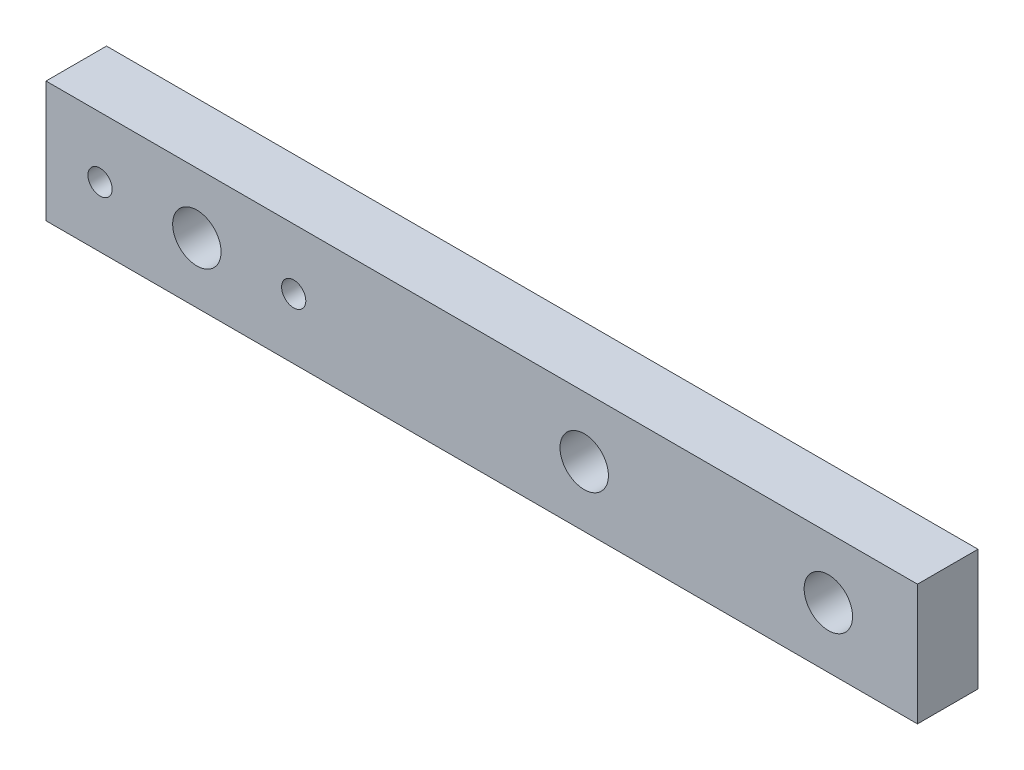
ISO-10303-21;
HEADER;
FILE_DESCRIPTION(('STEP AP214'),'2;1');
FILE_NAME('part.step','',(''),(''),'','','');
FILE_SCHEMA(('AUTOMOTIVE_DESIGN { 1 0 10303 214 1 1 1 1 }'));
ENDSEC;
DATA;
#1=APPLICATION_CONTEXT('core data for automotive mechanical design processes');
#2=APPLICATION_PROTOCOL_DEFINITION('international standard','automotive_design',2000,#1);
#3=PRODUCT_CONTEXT('',#1,'mechanical');
#4=PRODUCT('Part','Part','',(#3));
#5=PRODUCT_RELATED_PRODUCT_CATEGORY('part','',(#4));
#6=PRODUCT_DEFINITION_FORMATION('','',#4);
#7=PRODUCT_DEFINITION_CONTEXT('part definition',#1,'design');
#8=PRODUCT_DEFINITION('design','',#6,#7);
#9=PRODUCT_DEFINITION_SHAPE('','',#8);
#10=(LENGTH_UNIT() NAMED_UNIT(*) SI_UNIT(.MILLI.,.METRE.));
#11=(NAMED_UNIT(*) PLANE_ANGLE_UNIT() SI_UNIT($,.RADIAN.));
#12=(NAMED_UNIT(*) SI_UNIT($,.STERADIAN.) SOLID_ANGLE_UNIT());
#13=UNCERTAINTY_MEASURE_WITH_UNIT(LENGTH_MEASURE(1.E-05),#10,'distance_accuracy_value','');
#14=(GEOMETRIC_REPRESENTATION_CONTEXT(3) GLOBAL_UNCERTAINTY_ASSIGNED_CONTEXT((#13)) GLOBAL_UNIT_ASSIGNED_CONTEXT((#10,
#11,#12)) REPRESENTATION_CONTEXT('',''));
#15=CARTESIAN_POINT('',(0.,0.,0.));
#16=DIRECTION('',(0.,0.,1.));
#17=DIRECTION('',(1.,0.,0.));
#18=AXIS2_PLACEMENT_3D('',#15,#16,#17);
#19=CARTESIAN_POINT('',(-37.,5.,5.));
#20=DIRECTION('',(1.,0.,0.));
#21=DIRECTION('',(0.,0.,-1.));
#22=AXIS2_PLACEMENT_3D('',#19,#20,#21);
#23=PLANE('',#22);
#24=DIRECTION('',(0.,-1.,0.));
#25=VECTOR('',#24,1.);
#26=CARTESIAN_POINT('',(-37.,5.,0.));
#27=LINE('',#26,#25);
#28=CARTESIAN_POINT('',(-37.,5.,0.));
#29=VERTEX_POINT('',#28);
#30=CARTESIAN_POINT('',(-37.,-5.,0.));
#31=VERTEX_POINT('',#30);
#32=EDGE_CURVE('E100',#29,#31,#27,.T.);
#33=ORIENTED_EDGE('',*,*,#32,.T.);
#34=DIRECTION('',(0.,0.,-1.));
#35=VECTOR('',#34,1.);
#36=CARTESIAN_POINT('',(-37.,-5.,5.));
#37=LINE('',#36,#35);
#38=CARTESIAN_POINT('',(-37.,-5.,5.));
#39=VERTEX_POINT('',#38);
#40=EDGE_CURVE('E11',#39,#31,#37,.T.);
#41=ORIENTED_EDGE('',*,*,#40,.F.);
#42=DIRECTION('',(0.,-1.,0.));
#43=VECTOR('',#42,1.);
#44=CARTESIAN_POINT('',(-37.,5.,5.));
#45=LINE('',#44,#43);
#46=CARTESIAN_POINT('',(-37.,5.,5.));
#47=VERTEX_POINT('',#46);
#48=EDGE_CURVE('E88',#47,#39,#45,.T.);
#49=ORIENTED_EDGE('',*,*,#48,.F.);
#50=DIRECTION('',(0.,0.,-1.));
#51=VECTOR('',#50,1.);
#52=CARTESIAN_POINT('',(-37.,5.,5.));
#53=LINE('',#52,#51);
#54=EDGE_CURVE('E96',#47,#29,#53,.T.);
#55=ORIENTED_EDGE('',*,*,#54,.T.);
#56=EDGE_LOOP('',(#33,#41,#49,#55));
#57=FACE_BOUND('',#56,.T.);
#58=ADVANCED_FACE('F37',(#57),#23,.F.);
#59=CARTESIAN_POINT('',(-37.,-5.,5.));
#60=DIRECTION('',(0.,1.,0.));
#61=DIRECTION('',(0.,0.,1.));
#62=AXIS2_PLACEMENT_3D('',#59,#60,#61);
#63=PLANE('',#62);
#64=DIRECTION('',(1.,0.,0.));
#65=VECTOR('',#64,1.);
#66=CARTESIAN_POINT('',(-37.,-5.,0.));
#67=LINE('',#66,#65);
#68=CARTESIAN_POINT('',(35.,-5.,0.));
#69=VERTEX_POINT('',#68);
#70=EDGE_CURVE('E92',#31,#69,#67,.T.);
#71=ORIENTED_EDGE('',*,*,#70,.T.);
#72=DIRECTION('',(0.,0.,-1.));
#73=VECTOR('',#72,1.);
#74=CARTESIAN_POINT('',(35.,-5.,5.));
#75=LINE('',#74,#73);
#76=CARTESIAN_POINT('',(35.,-5.,5.));
#77=VERTEX_POINT('',#76);
#78=EDGE_CURVE('E45',#77,#69,#75,.T.);
#79=ORIENTED_EDGE('',*,*,#78,.F.);
#80=DIRECTION('',(1.,0.,0.));
#81=VECTOR('',#80,1.);
#82=CARTESIAN_POINT('',(-37.,-5.,5.));
#83=LINE('',#82,#81);
#84=EDGE_CURVE('E83',#39,#77,#83,.T.);
#85=ORIENTED_EDGE('',*,*,#84,.F.);
#86=ORIENTED_EDGE('',*,*,#40,.T.);
#87=EDGE_LOOP('',(#71,#79,#85,#86));
#88=FACE_BOUND('',#87,.T.);
#89=ADVANCED_FACE('F91',(#88),#63,.F.);
#90=CARTESIAN_POINT('',(35.,5.,5.));
#91=DIRECTION('',(-1.,0.,0.));
#92=DIRECTION('',(0.,0.,1.));
#93=AXIS2_PLACEMENT_3D('',#90,#91,#92);
#94=PLANE('',#93);
#95=DIRECTION('',(0.,1.,0.));
#96=VECTOR('',#95,1.);
#97=CARTESIAN_POINT('',(35.,5.,0.));
#98=LINE('',#97,#96);
#99=CARTESIAN_POINT('',(35.,5.,0.));
#100=VERTEX_POINT('',#99);
#101=EDGE_CURVE('E70',#69,#100,#98,.T.);
#102=ORIENTED_EDGE('',*,*,#101,.T.);
#103=DIRECTION('',(0.,0.,-1.));
#104=VECTOR('',#103,1.);
#105=CARTESIAN_POINT('',(35.,5.,5.));
#106=LINE('',#105,#104);
#107=CARTESIAN_POINT('',(35.,5.,5.));
#108=VERTEX_POINT('',#107);
#109=EDGE_CURVE('E93',#108,#100,#106,.T.);
#110=ORIENTED_EDGE('',*,*,#109,.F.);
#111=DIRECTION('',(0.,1.,0.));
#112=VECTOR('',#111,1.);
#113=CARTESIAN_POINT('',(35.,5.,5.));
#114=LINE('',#113,#112);
#115=EDGE_CURVE('E86',#77,#108,#114,.T.);
#116=ORIENTED_EDGE('',*,*,#115,.F.);
#117=ORIENTED_EDGE('',*,*,#78,.T.);
#118=EDGE_LOOP('',(#102,#110,#116,#117));
#119=FACE_BOUND('',#118,.T.);
#120=ADVANCED_FACE('F94',(#119),#94,.F.);
#121=CARTESIAN_POINT('',(-37.,5.,5.));
#122=DIRECTION('',(0.,-1.,0.));
#123=DIRECTION('',(0.,0.,-1.));
#124=AXIS2_PLACEMENT_3D('',#121,#122,#123);
#125=PLANE('',#124);
#126=DIRECTION('',(-1.,0.,0.));
#127=VECTOR('',#126,1.);
#128=CARTESIAN_POINT('',(-37.,5.,0.));
#129=LINE('',#128,#127);
#130=EDGE_CURVE('E76',#100,#29,#129,.T.);
#131=ORIENTED_EDGE('',*,*,#130,.T.);
#132=ORIENTED_EDGE('',*,*,#54,.F.);
#133=DIRECTION('',(-1.,0.,0.));
#134=VECTOR('',#133,1.);
#135=CARTESIAN_POINT('',(-37.,5.,5.));
#136=LINE('',#135,#134);
#137=EDGE_CURVE('E53',#108,#47,#136,.T.);
#138=ORIENTED_EDGE('',*,*,#137,.F.);
#139=ORIENTED_EDGE('',*,*,#109,.T.);
#140=EDGE_LOOP('',(#131,#132,#138,#139));
#141=FACE_BOUND('',#140,.T.);
#142=ADVANCED_FACE('F108',(#141),#125,.F.);
#143=CARTESIAN_POINT('',(0.,0.,5.));
#144=DIRECTION('',(0.,0.,1.));
#145=DIRECTION('',(1.,0.,0.));
#146=AXIS2_PLACEMENT_3D('',#143,#144,#145);
#147=PLANE('',#146);
#148=CARTESIAN_POINT('',(27.6379525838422,0.,5.));
#149=DIRECTION('',(0.,0.,1.));
#150=DIRECTION('',(1.,0.,0.));
#151=AXIS2_PLACEMENT_3D('',#148,#149,#150);
#152=CIRCLE('',#151,2.);
#153=CARTESIAN_POINT('',(29.6379525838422,0.,5.));
#154=VERTEX_POINT('',#153);
#155=EDGE_CURVE('E138',#154,#154,#152,.T.);
#156=ORIENTED_EDGE('',*,*,#155,.F.);
#157=EDGE_LOOP('',(#156));
#158=FACE_BOUND('',#157,.T.);
#159=CARTESIAN_POINT('',(7.46454658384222,0.,5.));
#160=DIRECTION('',(0.,0.,1.));
#161=DIRECTION('',(1.,0.,0.));
#162=AXIS2_PLACEMENT_3D('',#159,#160,#161);
#163=CIRCLE('',#162,2.);
#164=CARTESIAN_POINT('',(9.46454658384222,0.,5.));
#165=VERTEX_POINT('',#164);
#166=EDGE_CURVE('E132',#165,#165,#163,.T.);
#167=ORIENTED_EDGE('',*,*,#166,.F.);
#168=EDGE_LOOP('',(#167));
#169=FACE_BOUND('',#168,.T.);
#170=CARTESIAN_POINT('',(-16.5354534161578,0.,5.));
#171=DIRECTION('',(0.,0.,1.));
#172=DIRECTION('',(1.,0.,0.));
#173=AXIS2_PLACEMENT_3D('',#170,#171,#172);
#174=CIRCLE('',#173,1.);
#175=CARTESIAN_POINT('',(-15.5354534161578,0.,5.));
#176=VERTEX_POINT('',#175);
#177=EDGE_CURVE('E126',#176,#176,#174,.T.);
#178=ORIENTED_EDGE('',*,*,#177,.F.);
#179=EDGE_LOOP('',(#178));
#180=FACE_BOUND('',#179,.T.);
#181=CARTESIAN_POINT('',(-24.5354534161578,0.,5.));
#182=DIRECTION('',(0.,0.,1.));
#183=DIRECTION('',(1.,0.,0.));
#184=AXIS2_PLACEMENT_3D('',#181,#182,#183);
#185=CIRCLE('',#184,2.);
#186=CARTESIAN_POINT('',(-22.5354534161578,0.,5.));
#187=VERTEX_POINT('',#186);
#188=EDGE_CURVE('E120',#187,#187,#185,.T.);
#189=ORIENTED_EDGE('',*,*,#188,.F.);
#190=EDGE_LOOP('',(#189));
#191=FACE_BOUND('',#190,.T.);
#192=CARTESIAN_POINT('',(-32.5354534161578,0.,5.));
#193=DIRECTION('',(0.,0.,1.));
#194=DIRECTION('',(1.,0.,0.));
#195=AXIS2_PLACEMENT_3D('',#192,#193,#194);
#196=CIRCLE('',#195,0.999999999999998);
#197=CARTESIAN_POINT('',(-31.5354534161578,0.,5.));
#198=VERTEX_POINT('',#197);
#199=EDGE_CURVE('E114',#198,#198,#196,.T.);
#200=ORIENTED_EDGE('',*,*,#199,.F.);
#201=EDGE_LOOP('',(#200));
#202=FACE_BOUND('',#201,.T.);
#203=ORIENTED_EDGE('',*,*,#48,.T.);
#204=ORIENTED_EDGE('',*,*,#84,.T.);
#205=ORIENTED_EDGE('',*,*,#115,.T.);
#206=ORIENTED_EDGE('',*,*,#137,.T.);
#207=EDGE_LOOP('',(#203,#204,#205,#206));
#208=FACE_BOUND('',#207,.T.);
#209=ADVANCED_FACE('F84',(#158,#169,#180,#191,#202,#208),#147,.T.);
#210=CARTESIAN_POINT('',(0.,0.,0.));
#211=DIRECTION('',(0.,0.,1.));
#212=DIRECTION('',(1.,0.,0.));
#213=AXIS2_PLACEMENT_3D('',#210,#211,#212);
#214=PLANE('',#213);
#215=CARTESIAN_POINT('',(27.6379525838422,0.,0.));
#216=DIRECTION('',(0.,0.,1.));
#217=DIRECTION('',(1.,0.,0.));
#218=AXIS2_PLACEMENT_3D('',#215,#216,#217);
#219=CIRCLE('',#218,2.);
#220=CARTESIAN_POINT('',(29.6379525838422,0.,0.));
#221=VERTEX_POINT('',#220);
#222=EDGE_CURVE('E135',#221,#221,#219,.T.);
#223=ORIENTED_EDGE('',*,*,#222,.T.);
#224=EDGE_LOOP('',(#223));
#225=FACE_BOUND('',#224,.T.);
#226=CARTESIAN_POINT('',(7.46454658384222,0.,0.));
#227=DIRECTION('',(0.,0.,1.));
#228=DIRECTION('',(1.,0.,0.));
#229=AXIS2_PLACEMENT_3D('',#226,#227,#228);
#230=CIRCLE('',#229,2.);
#231=CARTESIAN_POINT('',(9.46454658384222,0.,0.));
#232=VERTEX_POINT('',#231);
#233=EDGE_CURVE('E129',#232,#232,#230,.T.);
#234=ORIENTED_EDGE('',*,*,#233,.T.);
#235=EDGE_LOOP('',(#234));
#236=FACE_BOUND('',#235,.T.);
#237=CARTESIAN_POINT('',(-16.5354534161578,0.,0.));
#238=DIRECTION('',(0.,0.,1.));
#239=DIRECTION('',(1.,0.,0.));
#240=AXIS2_PLACEMENT_3D('',#237,#238,#239);
#241=CIRCLE('',#240,1.);
#242=CARTESIAN_POINT('',(-15.5354534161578,0.,0.));
#243=VERTEX_POINT('',#242);
#244=EDGE_CURVE('E123',#243,#243,#241,.T.);
#245=ORIENTED_EDGE('',*,*,#244,.T.);
#246=EDGE_LOOP('',(#245));
#247=FACE_BOUND('',#246,.T.);
#248=CARTESIAN_POINT('',(-24.5354534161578,0.,0.));
#249=DIRECTION('',(0.,0.,1.));
#250=DIRECTION('',(1.,0.,0.));
#251=AXIS2_PLACEMENT_3D('',#248,#249,#250);
#252=CIRCLE('',#251,2.);
#253=CARTESIAN_POINT('',(-22.5354534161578,0.,0.));
#254=VERTEX_POINT('',#253);
#255=EDGE_CURVE('E117',#254,#254,#252,.T.);
#256=ORIENTED_EDGE('',*,*,#255,.T.);
#257=EDGE_LOOP('',(#256));
#258=FACE_BOUND('',#257,.T.);
#259=CARTESIAN_POINT('',(-32.5354534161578,0.,0.));
#260=DIRECTION('',(0.,0.,1.));
#261=DIRECTION('',(1.,0.,0.));
#262=AXIS2_PLACEMENT_3D('',#259,#260,#261);
#263=CIRCLE('',#262,0.999999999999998);
#264=CARTESIAN_POINT('',(-31.5354534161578,0.,0.));
#265=VERTEX_POINT('',#264);
#266=EDGE_CURVE('E103',#265,#265,#263,.T.);
#267=ORIENTED_EDGE('',*,*,#266,.T.);
#268=EDGE_LOOP('',(#267));
#269=FACE_BOUND('',#268,.T.);
#270=ORIENTED_EDGE('',*,*,#32,.F.);
#271=ORIENTED_EDGE('',*,*,#130,.F.);
#272=ORIENTED_EDGE('',*,*,#101,.F.);
#273=ORIENTED_EDGE('',*,*,#70,.F.);
#274=EDGE_LOOP('',(#270,#271,#272,#273));
#275=FACE_BOUND('',#274,.T.);
#276=ADVANCED_FACE('F111',(#225,#236,#247,#258,#269,#275),#214,.F.);
#277=CARTESIAN_POINT('',(-32.5354534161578,0.,0.));
#278=DIRECTION('',(0.,0.,1.));
#279=DIRECTION('',(1.,0.,0.));
#280=AXIS2_PLACEMENT_3D('',#277,#278,#279);
#281=CYLINDRICAL_SURFACE('',#280,0.999999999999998);
#282=ORIENTED_EDGE('',*,*,#266,.F.);
#283=EDGE_LOOP('',(#282));
#284=FACE_BOUND('',#283,.T.);
#285=ORIENTED_EDGE('',*,*,#199,.T.);
#286=EDGE_LOOP('',(#285));
#287=FACE_BOUND('',#286,.T.);
#288=ADVANCED_FACE('F164',(#284,#287),#281,.F.);
#289=CARTESIAN_POINT('',(-24.5354534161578,0.,0.));
#290=DIRECTION('',(0.,0.,1.));
#291=DIRECTION('',(1.,0.,0.));
#292=AXIS2_PLACEMENT_3D('',#289,#290,#291);
#293=CYLINDRICAL_SURFACE('',#292,2.);
#294=ORIENTED_EDGE('',*,*,#255,.F.);
#295=EDGE_LOOP('',(#294));
#296=FACE_BOUND('',#295,.T.);
#297=ORIENTED_EDGE('',*,*,#188,.T.);
#298=EDGE_LOOP('',(#297));
#299=FACE_BOUND('',#298,.T.);
#300=ADVANCED_FACE('F166',(#296,#299),#293,.F.);
#301=CARTESIAN_POINT('',(-16.5354534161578,0.,0.));
#302=DIRECTION('',(0.,0.,1.));
#303=DIRECTION('',(1.,0.,0.));
#304=AXIS2_PLACEMENT_3D('',#301,#302,#303);
#305=CYLINDRICAL_SURFACE('',#304,1.);
#306=ORIENTED_EDGE('',*,*,#244,.F.);
#307=EDGE_LOOP('',(#306));
#308=FACE_BOUND('',#307,.T.);
#309=ORIENTED_EDGE('',*,*,#177,.T.);
#310=EDGE_LOOP('',(#309));
#311=FACE_BOUND('',#310,.T.);
#312=ADVANCED_FACE('F173',(#308,#311),#305,.F.);
#313=CARTESIAN_POINT('',(7.46454658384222,0.,0.));
#314=DIRECTION('',(0.,0.,1.));
#315=DIRECTION('',(1.,0.,0.));
#316=AXIS2_PLACEMENT_3D('',#313,#314,#315);
#317=CYLINDRICAL_SURFACE('',#316,2.);
#318=ORIENTED_EDGE('',*,*,#233,.F.);
#319=EDGE_LOOP('',(#318));
#320=FACE_BOUND('',#319,.T.);
#321=ORIENTED_EDGE('',*,*,#166,.T.);
#322=EDGE_LOOP('',(#321));
#323=FACE_BOUND('',#322,.T.);
#324=ADVANCED_FACE('F149',(#320,#323),#317,.F.);
#325=CARTESIAN_POINT('',(27.6379525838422,0.,0.));
#326=DIRECTION('',(0.,0.,1.));
#327=DIRECTION('',(1.,0.,0.));
#328=AXIS2_PLACEMENT_3D('',#325,#326,#327);
#329=CYLINDRICAL_SURFACE('',#328,2.);
#330=ORIENTED_EDGE('',*,*,#222,.F.);
#331=EDGE_LOOP('',(#330));
#332=FACE_BOUND('',#331,.T.);
#333=ORIENTED_EDGE('',*,*,#155,.T.);
#334=EDGE_LOOP('',(#333));
#335=FACE_BOUND('',#334,.T.);
#336=ADVANCED_FACE('F146',(#332,#335),#329,.F.);
#337=CLOSED_SHELL('',(#58,#89,#120,#142,#209,#276,#288,#300,#312,#324,#336));
#338=MANIFOLD_SOLID_BREP('B2',#337);
#339=ADVANCED_BREP_SHAPE_REPRESENTATION('',(#18,#338),#14);
#340=SHAPE_DEFINITION_REPRESENTATION(#9,#339);
ENDSEC;
END-ISO-10303-21;
